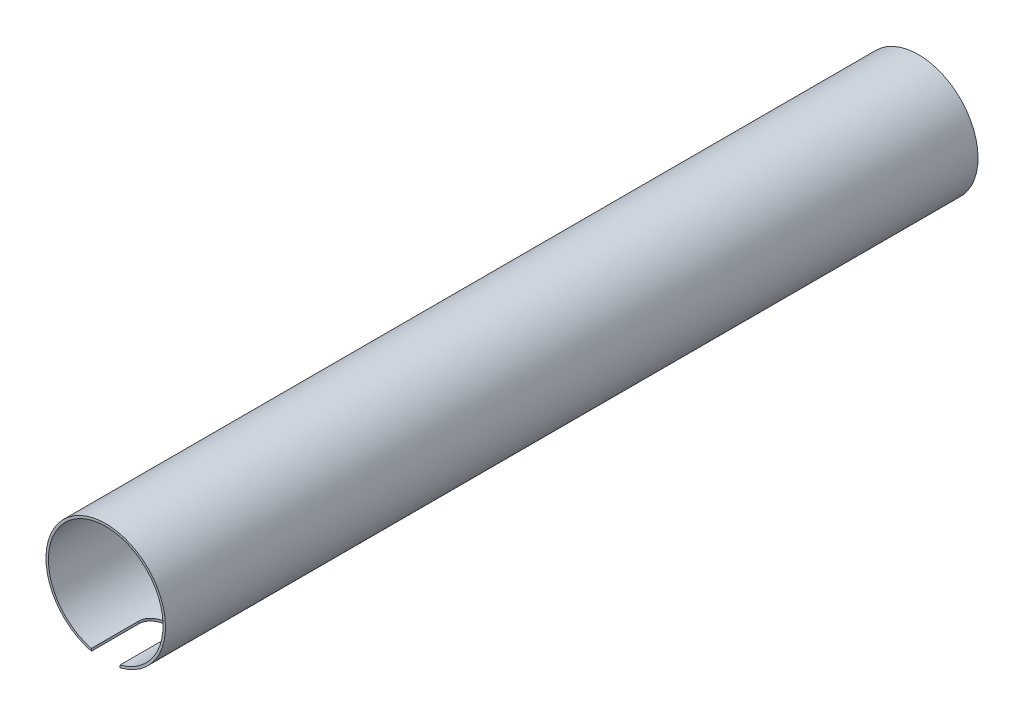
ISO-10303-21;
HEADER;
FILE_DESCRIPTION(('STEP AP214'),'2;1');
FILE_NAME('part.step','',(''),(''),'','','');
FILE_SCHEMA(('AUTOMOTIVE_DESIGN { 1 0 10303 214 1 1 1 1 }'));
ENDSEC;
DATA;
#1=APPLICATION_CONTEXT('core data for automotive mechanical design processes');
#2=APPLICATION_PROTOCOL_DEFINITION('international standard','automotive_design',2000,#1);
#3=PRODUCT_CONTEXT('',#1,'mechanical');
#4=PRODUCT('Part','Part','',(#3));
#5=PRODUCT_RELATED_PRODUCT_CATEGORY('part','',(#4));
#6=PRODUCT_DEFINITION_FORMATION('','',#4);
#7=PRODUCT_DEFINITION_CONTEXT('part definition',#1,'design');
#8=PRODUCT_DEFINITION('design','',#6,#7);
#9=PRODUCT_DEFINITION_SHAPE('','',#8);
#10=(LENGTH_UNIT() NAMED_UNIT(*) SI_UNIT(.MILLI.,.METRE.));
#11=(NAMED_UNIT(*) PLANE_ANGLE_UNIT() SI_UNIT($,.RADIAN.));
#12=(NAMED_UNIT(*) SI_UNIT($,.STERADIAN.) SOLID_ANGLE_UNIT());
#13=UNCERTAINTY_MEASURE_WITH_UNIT(LENGTH_MEASURE(1.E-05),#10,'distance_accuracy_value','');
#14=(GEOMETRIC_REPRESENTATION_CONTEXT(3) GLOBAL_UNCERTAINTY_ASSIGNED_CONTEXT((#13)) GLOBAL_UNIT_ASSIGNED_CONTEXT((#10,
#11,#12)) REPRESENTATION_CONTEXT('',''));
#15=CARTESIAN_POINT('',(0.,0.,0.));
#16=DIRECTION('',(0.,0.,1.));
#17=DIRECTION('',(1.,0.,0.));
#18=AXIS2_PLACEMENT_3D('',#15,#16,#17);
#19=CARTESIAN_POINT('',(3.,-12.5,180.));
#20=DIRECTION('',(1.,0.,0.));
#21=DIRECTION('',(0.,0.,-1.));
#22=AXIS2_PLACEMENT_3D('',#19,#20,#21);
#23=PLANE('',#22);
#24=DIRECTION('',(0.,1.,0.));
#25=VECTOR('',#24,1.);
#26=CARTESIAN_POINT('',(3.,0.,170.));
#27=LINE('',#26,#25);
#28=CARTESIAN_POINT('',(3.,-12.1346610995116,170.));
#29=VERTEX_POINT('',#28);
#30=CARTESIAN_POINT('',(3.,-11.6189500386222,170.));
#31=VERTEX_POINT('',#30);
#32=EDGE_CURVE('E186',#29,#31,#27,.T.);
#33=ORIENTED_EDGE('',*,*,#32,.T.);
#34=DIRECTION('',(0.,0.,-1.));
#35=VECTOR('',#34,1.);
#36=CARTESIAN_POINT('',(3.,-11.6189500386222,170.));
#37=LINE('',#36,#35);
#38=CARTESIAN_POINT('',(3.,-11.6189500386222,160.));
#39=VERTEX_POINT('',#38);
#40=EDGE_CURVE('E188',#31,#39,#37,.T.);
#41=ORIENTED_EDGE('',*,*,#40,.T.);
#42=DIRECTION('',(0.,1.,0.));
#43=VECTOR('',#42,1.);
#44=CARTESIAN_POINT('',(3.,-12.5,160.));
#45=LINE('',#44,#43);
#46=CARTESIAN_POINT('',(3.,-12.1346610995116,160.));
#47=VERTEX_POINT('',#46);
#48=EDGE_CURVE('E11',#47,#39,#45,.T.);
#49=ORIENTED_EDGE('',*,*,#48,.F.);
#50=DIRECTION('',(0.,0.,-1.));
#51=VECTOR('',#50,1.);
#52=CARTESIAN_POINT('',(3.,-12.1346610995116,170.));
#53=LINE('',#52,#51);
#54=EDGE_CURVE('E154',#29,#47,#53,.T.);
#55=ORIENTED_EDGE('',*,*,#54,.F.);
#56=EDGE_LOOP('',(#33,#41,#49,#55));
#57=FACE_BOUND('',#56,.T.);
#58=ADVANCED_FACE('F17',(#57),#23,.F.);
#59=CARTESIAN_POINT('',(0.,-12.5,160.));
#60=DIRECTION('',(0.,1.,0.));
#61=DIRECTION('',(0.,0.,1.));
#62=AXIS2_PLACEMENT_3D('',#59,#60,#61);
#63=CYLINDRICAL_SURFACE('',#62,3.);
#64=ORIENTED_EDGE('',*,*,#48,.T.);
#65=CARTESIAN_POINT('',(3.,-11.6189500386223,160.));
#66=CARTESIAN_POINT('',(3.00000961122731,-11.6189407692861,159.91703465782));
#67=CARTESIAN_POINT('',(2.99655852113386,-11.6198384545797,159.834075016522));
#68=CARTESIAN_POINT('',(2.98280958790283,-11.623378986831,159.668776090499));
#69=CARTESIAN_POINT('',(2.9725128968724,-11.6260215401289,159.586436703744));
#70=CARTESIAN_POINT('',(2.94517439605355,-11.632976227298,159.423120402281));
#71=CARTESIAN_POINT('',(2.92814595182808,-11.6372850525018,159.342141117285));
#72=CARTESIAN_POINT('',(2.88750208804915,-11.6474360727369,159.181973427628));
#73=CARTESIAN_POINT('',(2.86388657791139,-11.6532782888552,159.102785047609));
#74=CARTESIAN_POINT('',(2.78341859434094,-11.67286043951,158.868747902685));
#75=CARTESIAN_POINT('',(2.71691695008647,-11.6886633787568,158.717263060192));
#76=CARTESIAN_POINT('',(2.56023959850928,-11.7239746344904,158.427632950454));
#77=CARTESIAN_POINT('',(2.47005754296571,-11.7434839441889,158.289491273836));
#78=CARTESIAN_POINT('',(2.26645521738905,-11.7844877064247,158.027377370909));
#79=CARTESIAN_POINT('',(2.15261228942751,-11.806013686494,157.903737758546));
#80=CARTESIAN_POINT('',(1.90582685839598,-11.8483531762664,157.677091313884));
#81=CARTESIAN_POINT('',(1.7728813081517,-11.8691665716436,157.574087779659));
#82=CARTESIAN_POINT('',(1.48937083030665,-11.9080854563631,157.390267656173));
#83=CARTESIAN_POINT('',(1.33858605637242,-11.926149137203,157.309780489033));
#84=CARTESIAN_POINT('',(1.0251077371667,-11.9571703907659,157.17542562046));
#85=CARTESIAN_POINT('',(0.862416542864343,-11.9701289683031,157.12155268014));
#86=CARTESIAN_POINT('',(0.533232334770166,-11.9892569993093,157.043023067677));
#87=CARTESIAN_POINT('',(0.366882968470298,-11.9955585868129,157.01779699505));
#88=CARTESIAN_POINT('',(0.0321983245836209,-12.0011231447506,156.995489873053));
#89=CARTESIAN_POINT('',(-0.136136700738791,-12.0003869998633,156.998405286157));
#90=CARTESIAN_POINT('',(-0.4660574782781,-11.9920571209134,157.03188989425));
#91=CARTESIAN_POINT('',(-0.627710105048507,-11.984615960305,157.061843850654));
#92=CARTESIAN_POINT('',(-0.943616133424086,-11.9638899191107,157.147566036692));
#93=CARTESIAN_POINT('',(-1.097869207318,-11.9506047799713,157.203335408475));
#94=CARTESIAN_POINT('',(-1.39622185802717,-11.9194499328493,157.339603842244));
#95=CARTESIAN_POINT('',(-1.54021688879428,-11.901539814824,157.420322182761));
#96=CARTESIAN_POINT('',(-1.8128298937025,-11.8630783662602,157.604029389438));
#97=CARTESIAN_POINT('',(-1.94144554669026,-11.8425266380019,157.707021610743));
#98=CARTESIAN_POINT('',(-2.18330816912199,-11.8003669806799,157.935636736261));
#99=CARTESIAN_POINT('',(-2.2960473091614,-11.7787455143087,158.061794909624));
#100=CARTESIAN_POINT('',(-2.49890872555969,-11.7373850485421,158.331489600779));
#101=CARTESIAN_POINT('',(-2.58902481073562,-11.7176465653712,158.475030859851));
#102=CARTESIAN_POINT('',(-2.74441412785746,-11.6822344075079,158.776436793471));
#103=CARTESIAN_POINT('',(-2.80955105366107,-11.666583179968,158.934374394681));
#104=CARTESIAN_POINT('',(-2.91210705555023,-11.6414117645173,159.259350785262));
#105=CARTESIAN_POINT('',(-2.94956756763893,-11.6318824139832,159.426375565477));
#106=CARTESIAN_POINT('',(-2.98171390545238,-11.6236587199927,159.66237214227));
#107=CARTESIAN_POINT('',(-2.98857237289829,-11.6218956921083,159.729759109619));
#108=CARTESIAN_POINT('',(-2.99771027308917,-11.6195418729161,159.864753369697));
#109=CARTESIAN_POINT('',(-2.99999711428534,-11.6189491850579,159.932360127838));
#110=CARTESIAN_POINT('',(-3.,-11.6189500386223,160.));
#111=B_SPLINE_CURVE_WITH_KNOTS('',3,(#65,#66,#67,#68,#69,#70,#71,#72,#73,#74,#75,#76,#77,#78,
#79,#80,#81,#82,#83,#84,#85,#86,#87,#88,#89,#90,#91,#92,#93,#94,#95,#96,#97,#98,#99,#100,#101,
#102,#103,#104,#105,#106,#107,#108,#109,#110),.UNSPECIFIED.,.F.,.F.,(4,2,2,2,2,2,2,2,2,2,2,2,2,
2,2,2,2,2,2,2,2,2,4),(0.,0.248809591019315,0.497577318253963,0.745853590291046,
0.994133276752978,1.49019923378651,1.98639831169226,2.49236907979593,2.99842064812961,
3.51152900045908,4.02453630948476,4.52715783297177,5.02971617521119,5.52111975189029,
6.01254507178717,6.50841867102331,7.0043670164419,7.51368627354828,8.02314476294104,
8.53534499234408,9.04677681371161,9.24991884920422,9.45273141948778),.UNSPECIFIED.);
#112=CARTESIAN_POINT('',(-3.,-11.6189500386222,160.));
#113=VERTEX_POINT('',#112);
#114=EDGE_CURVE('E129',#39,#113,#111,.T.);
#115=ORIENTED_EDGE('',*,*,#114,.T.);
#116=DIRECTION('',(0.,1.,0.));
#117=VECTOR('',#116,1.);
#118=CARTESIAN_POINT('',(-3.,-12.5,160.));
#119=LINE('',#118,#117);
#120=CARTESIAN_POINT('',(-3.,-12.1346610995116,160.));
#121=VERTEX_POINT('',#120);
#122=EDGE_CURVE('E33',#121,#113,#119,.T.);
#123=ORIENTED_EDGE('',*,*,#122,.F.);
#124=CARTESIAN_POINT('',(3.,-12.1346610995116,160.));
#125=CARTESIAN_POINT('',(3.00000949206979,-12.1346522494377,159.916922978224));
#126=CARTESIAN_POINT('',(2.9965492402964,-12.1355140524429,159.833851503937));
#127=CARTESIAN_POINT('',(2.9827629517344,-12.1389133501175,159.668327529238));
#128=CARTESIAN_POINT('',(2.97243800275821,-12.1414505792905,159.585874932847));
#129=CARTESIAN_POINT('',(2.94502172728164,-12.1481288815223,159.422323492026));
#130=CARTESIAN_POINT('',(2.92794313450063,-12.1522669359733,159.341222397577));
#131=CARTESIAN_POINT('',(2.88717657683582,-12.1620165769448,159.180811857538));
#132=CARTESIAN_POINT('',(2.86348853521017,-12.1676281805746,159.101502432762));
#133=CARTESIAN_POINT('',(2.7827647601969,-12.1864398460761,158.86709852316));
#134=CARTESIAN_POINT('',(2.71604288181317,-12.2016236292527,158.715371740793));
#135=CARTESIAN_POINT('',(2.55882843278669,-12.2355556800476,158.425304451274));
#136=CARTESIAN_POINT('',(2.46833033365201,-12.2543047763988,158.286967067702));
#137=CARTESIAN_POINT('',(2.26416625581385,-12.2936784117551,158.024742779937));
#138=CARTESIAN_POINT('',(2.15010988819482,-12.3143307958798,157.901163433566));
#139=CARTESIAN_POINT('',(1.90290471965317,-12.3549430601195,157.67469002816));
#140=CARTESIAN_POINT('',(1.76975289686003,-12.3749028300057,157.571799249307));
#141=CARTESIAN_POINT('',(1.48603085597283,-12.4121880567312,157.388371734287));
#142=CARTESIAN_POINT('',(1.33525974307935,-12.4294765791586,157.308137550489));
#143=CARTESIAN_POINT('',(1.02189537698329,-12.4591517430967,157.174270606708));
#144=CARTESIAN_POINT('',(0.859304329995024,-12.4715392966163,157.120632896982));
#145=CARTESIAN_POINT('',(0.530138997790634,-12.4898199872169,157.042462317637));
#146=CARTESIAN_POINT('',(0.363696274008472,-12.4958303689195,157.017403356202));
#147=CARTESIAN_POINT('',(0.028864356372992,-12.5010873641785,156.995452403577));
#148=CARTESIAN_POINT('',(-0.139524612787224,-12.5003347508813,156.998557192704));
#149=CARTESIAN_POINT('',(-0.469819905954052,-12.4922383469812,157.032463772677));
#150=CARTESIAN_POINT('',(-0.631788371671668,-12.4850297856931,157.062697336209));
#151=CARTESIAN_POINT('',(-0.948281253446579,-12.464987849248,157.149092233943));
#152=CARTESIAN_POINT('',(-1.10280535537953,-12.4521542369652,157.205254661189));
#153=CARTESIAN_POINT('',(-1.40155039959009,-12.4220935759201,157.342387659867));
#154=CARTESIAN_POINT('',(-1.54567254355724,-12.4048300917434,157.423565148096));
#155=CARTESIAN_POINT('',(-1.81844702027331,-12.3677898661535,157.608266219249));
#156=CARTESIAN_POINT('',(-1.94709723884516,-12.3480127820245,157.711792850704));
#157=CARTESIAN_POINT('',(-2.18865245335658,-12.307525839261,157.941301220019));
#158=CARTESIAN_POINT('',(-2.30108617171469,-12.2868050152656,158.067777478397));
#159=CARTESIAN_POINT('',(-2.50327463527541,-12.2472145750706,158.338044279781));
#160=CARTESIAN_POINT('',(-2.59302318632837,-12.2283454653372,158.481839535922));
#161=CARTESIAN_POINT('',(-2.74756993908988,-12.1945549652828,158.783555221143));
#162=CARTESIAN_POINT('',(-2.81224875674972,-12.1796525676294,158.941538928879));
#163=CARTESIAN_POINT('',(-2.91390343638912,-12.1557369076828,159.266484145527));
#164=CARTESIAN_POINT('',(-2.95092063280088,-12.1467148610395,159.43343185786));
#165=CARTESIAN_POINT('',(-2.98233825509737,-12.139016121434,159.668168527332));
#166=CARTESIAN_POINT('',(-2.98896283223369,-12.1373853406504,159.734406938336));
#167=CARTESIAN_POINT('',(-2.9977885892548,-12.1352084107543,159.867086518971));
#168=CARTESIAN_POINT('',(-2.99999700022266,-12.1346604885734,159.933527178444));
#169=CARTESIAN_POINT('',(-3.,-12.1346610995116,160.));
#170=B_SPLINE_CURVE_WITH_KNOTS('',3,(#124,#125,#126,#127,#128,#129,#130,#131,#132,#133,#134,
#135,#136,#137,#138,#139,#140,#141,#142,#143,#144,#145,#146,#147,#148,#149,#150,#151,#152,#153,
#154,#155,#156,#157,#158,#159,#160,#161,#162,#163,#164,#165,#166,#167,#168,#169),.UNSPECIFIED.,
.F.,.F.,(4,2,2,2,2,2,2,2,2,2,2,2,2,2,2,2,2,2,2,2,2,2,4),(0.,0.249144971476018,0.498250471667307,
0.746888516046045,0.99552944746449,1.49234020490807,1.98926658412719,2.49520478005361,
3.00122312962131,3.51370966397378,4.02610078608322,4.52889907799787,5.03163989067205,
5.52409016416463,6.01656119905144,6.51322041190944,7.00994741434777,7.51903074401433,
8.02825292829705,8.53987111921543,9.05072326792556,9.2503660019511,9.44968157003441),.UNSPECIFIED.);
#171=EDGE_CURVE('E146',#47,#121,#170,.T.);
#172=ORIENTED_EDGE('',*,*,#171,.F.);
#173=EDGE_LOOP('',(#64,#115,#123,#172));
#174=FACE_BOUND('',#173,.T.);
#175=ADVANCED_FACE('F155',(#174),#63,.F.);
#176=CARTESIAN_POINT('',(-3.,-12.5,180.));
#177=DIRECTION('',(-1.,0.,0.));
#178=DIRECTION('',(0.,1.,0.));
#179=AXIS2_PLACEMENT_3D('',#176,#177,#178);
#180=PLANE('',#179);
#181=ORIENTED_EDGE('',*,*,#122,.T.);
#182=DIRECTION('',(0.,0.,1.));
#183=VECTOR('',#182,1.);
#184=CARTESIAN_POINT('',(-3.,-11.6189500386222,170.));
#185=LINE('',#184,#183);
#186=CARTESIAN_POINT('',(-3.,-11.6189500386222,170.));
#187=VERTEX_POINT('',#186);
#188=EDGE_CURVE('E237',#113,#187,#185,.T.);
#189=ORIENTED_EDGE('',*,*,#188,.T.);
#190=DIRECTION('',(0.,-1.,0.));
#191=VECTOR('',#190,1.);
#192=CARTESIAN_POINT('',(-3.,0.,170.));
#193=LINE('',#192,#191);
#194=CARTESIAN_POINT('',(-3.,-12.1346610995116,170.));
#195=VERTEX_POINT('',#194);
#196=EDGE_CURVE('E196',#187,#195,#193,.T.);
#197=ORIENTED_EDGE('',*,*,#196,.T.);
#198=DIRECTION('',(0.,0.,1.));
#199=VECTOR('',#198,1.);
#200=CARTESIAN_POINT('',(-3.,-12.1346610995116,170.));
#201=LINE('',#200,#199);
#202=EDGE_CURVE('E153',#121,#195,#201,.T.);
#203=ORIENTED_EDGE('',*,*,#202,.F.);
#204=EDGE_LOOP('',(#181,#189,#197,#203));
#205=FACE_BOUND('',#204,.T.);
#206=ADVANCED_FACE('F159',(#205),#180,.F.);
#207=CARTESIAN_POINT('',(3.,-12.5,10.));
#208=DIRECTION('',(1.,0.,0.));
#209=DIRECTION('',(0.,0.,-1.));
#210=AXIS2_PLACEMENT_3D('',#207,#208,#209);
#211=PLANE('',#210);
#212=DIRECTION('',(0.,1.,0.));
#213=VECTOR('',#212,1.);
#214=CARTESIAN_POINT('',(3.,-12.5,10.));
#215=LINE('',#214,#213);
#216=CARTESIAN_POINT('',(3.,-12.1346610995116,10.));
#217=VERTEX_POINT('',#216);
#218=CARTESIAN_POINT('',(3.,-11.6189500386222,10.));
#219=VERTEX_POINT('',#218);
#220=EDGE_CURVE('E97',#217,#219,#215,.T.);
#221=ORIENTED_EDGE('',*,*,#220,.T.);
#222=DIRECTION('',(0.,0.,-1.));
#223=VECTOR('',#222,1.);
#224=CARTESIAN_POINT('',(3.,-11.6189500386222,170.));
#225=LINE('',#224,#223);
#226=CARTESIAN_POINT('',(3.,-11.6189500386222,0.));
#227=VERTEX_POINT('',#226);
#228=EDGE_CURVE('E83',#219,#227,#225,.T.);
#229=ORIENTED_EDGE('',*,*,#228,.T.);
#230=DIRECTION('',(0.,1.,0.));
#231=VECTOR('',#230,1.);
#232=CARTESIAN_POINT('',(3.,0.,0.));
#233=LINE('',#232,#231);
#234=CARTESIAN_POINT('',(3.,-12.1346610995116,0.));
#235=VERTEX_POINT('',#234);
#236=EDGE_CURVE('E100',#235,#227,#233,.T.);
#237=ORIENTED_EDGE('',*,*,#236,.F.);
#238=DIRECTION('',(0.,0.,-1.));
#239=VECTOR('',#238,1.);
#240=CARTESIAN_POINT('',(3.,-12.1346610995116,170.));
#241=LINE('',#240,#239);
#242=EDGE_CURVE('E95',#217,#235,#241,.T.);
#243=ORIENTED_EDGE('',*,*,#242,.F.);
#244=EDGE_LOOP('',(#221,#229,#237,#243));
#245=FACE_BOUND('',#244,.T.);
#246=ADVANCED_FACE('F96',(#245),#211,.F.);
#247=CARTESIAN_POINT('',(-3.,-12.5,10.));
#248=DIRECTION('',(-1.,0.,0.));
#249=DIRECTION('',(0.,1.,0.));
#250=AXIS2_PLACEMENT_3D('',#247,#248,#249);
#251=PLANE('',#250);
#252=DIRECTION('',(0.,-1.,0.));
#253=VECTOR('',#252,1.);
#254=CARTESIAN_POINT('',(-3.,0.,0.));
#255=LINE('',#254,#253);
#256=CARTESIAN_POINT('',(-3.,-11.6189500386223,0.));
#257=VERTEX_POINT('',#256);
#258=CARTESIAN_POINT('',(-3.,-12.1346610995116,0.));
#259=VERTEX_POINT('',#258);
#260=EDGE_CURVE('E195',#257,#259,#255,.T.);
#261=ORIENTED_EDGE('',*,*,#260,.F.);
#262=DIRECTION('',(0.,0.,1.));
#263=VECTOR('',#262,1.);
#264=CARTESIAN_POINT('',(-3.,-11.6189500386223,170.));
#265=LINE('',#264,#263);
#266=CARTESIAN_POINT('',(-3.,-11.6189500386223,10.));
#267=VERTEX_POINT('',#266);
#268=EDGE_CURVE('E240',#257,#267,#265,.T.);
#269=ORIENTED_EDGE('',*,*,#268,.T.);
#270=DIRECTION('',(0.,1.,0.));
#271=VECTOR('',#270,1.);
#272=CARTESIAN_POINT('',(-3.,-12.5,10.));
#273=LINE('',#272,#271);
#274=CARTESIAN_POINT('',(-3.,-12.1346610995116,10.));
#275=VERTEX_POINT('',#274);
#276=EDGE_CURVE('E104',#275,#267,#273,.T.);
#277=ORIENTED_EDGE('',*,*,#276,.F.);
#278=DIRECTION('',(0.,0.,1.));
#279=VECTOR('',#278,1.);
#280=CARTESIAN_POINT('',(-3.,-12.1346610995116,170.));
#281=LINE('',#280,#279);
#282=EDGE_CURVE('E105',#259,#275,#281,.T.);
#283=ORIENTED_EDGE('',*,*,#282,.F.);
#284=EDGE_LOOP('',(#261,#269,#277,#283));
#285=FACE_BOUND('',#284,.T.);
#286=ADVANCED_FACE('F164',(#285),#251,.F.);
#287=CARTESIAN_POINT('',(0.,0.,0.));
#288=DIRECTION('',(0.,0.,1.));
#289=DIRECTION('',(1.,0.,0.));
#290=AXIS2_PLACEMENT_3D('',#287,#288,#289);
#291=PLANE('',#290);
#292=CARTESIAN_POINT('',(0.,0.,0.));
#293=DIRECTION('',(0.,0.,1.));
#294=DIRECTION('',(1.,0.,0.));
#295=AXIS2_PLACEMENT_3D('',#292,#293,#294);
#296=CIRCLE('',#295,12.);
#297=EDGE_CURVE('E208',#227,#257,#296,.T.);
#298=ORIENTED_EDGE('',*,*,#297,.T.);
#299=ORIENTED_EDGE('',*,*,#260,.T.);
#300=CARTESIAN_POINT('',(0.,0.,0.));
#301=DIRECTION('',(0.,0.,1.));
#302=DIRECTION('',(1.,0.,0.));
#303=AXIS2_PLACEMENT_3D('',#300,#301,#302);
#304=CIRCLE('',#303,12.5);
#305=EDGE_CURVE('E215',#235,#259,#304,.T.);
#306=ORIENTED_EDGE('',*,*,#305,.F.);
#307=ORIENTED_EDGE('',*,*,#236,.T.);
#308=EDGE_LOOP('',(#298,#299,#306,#307));
#309=FACE_BOUND('',#308,.T.);
#310=ADVANCED_FACE('F167',(#309),#291,.F.);
#311=CARTESIAN_POINT('',(0.,0.,170.));
#312=DIRECTION('',(0.,0.,1.));
#313=DIRECTION('',(1.,0.,0.));
#314=AXIS2_PLACEMENT_3D('',#311,#312,#313);
#315=PLANE('',#314);
#316=ORIENTED_EDGE('',*,*,#196,.F.);
#317=CARTESIAN_POINT('',(0.,0.,170.));
#318=DIRECTION('',(0.,0.,1.));
#319=DIRECTION('',(1.,0.,0.));
#320=AXIS2_PLACEMENT_3D('',#317,#318,#319);
#321=CIRCLE('',#320,12.);
#322=EDGE_CURVE('E110',#31,#187,#321,.T.);
#323=ORIENTED_EDGE('',*,*,#322,.F.);
#324=ORIENTED_EDGE('',*,*,#32,.F.);
#325=CARTESIAN_POINT('',(0.,0.,170.));
#326=DIRECTION('',(0.,0.,1.));
#327=DIRECTION('',(1.,0.,0.));
#328=AXIS2_PLACEMENT_3D('',#325,#326,#327);
#329=CIRCLE('',#328,12.5);
#330=EDGE_CURVE('E204',#29,#195,#329,.T.);
#331=ORIENTED_EDGE('',*,*,#330,.T.);
#332=EDGE_LOOP('',(#316,#323,#324,#331));
#333=FACE_BOUND('',#332,.T.);
#334=ADVANCED_FACE('F143',(#333),#315,.T.);
#335=CARTESIAN_POINT('',(0.,0.,170.));
#336=DIRECTION('',(0.,0.,-1.));
#337=DIRECTION('',(-1.,0.,0.));
#338=AXIS2_PLACEMENT_3D('',#335,#336,#337);
#339=CYLINDRICAL_SURFACE('',#338,12.5);
#340=ORIENTED_EDGE('',*,*,#242,.T.);
#341=ORIENTED_EDGE('',*,*,#305,.T.);
#342=ORIENTED_EDGE('',*,*,#282,.T.);
#343=CARTESIAN_POINT('',(-3.,-12.1346610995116,10.));
#344=CARTESIAN_POINT('',(-3.00000949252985,-12.1346522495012,10.0830769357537));
#345=CARTESIAN_POINT('',(-2.99654924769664,-12.1355140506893,10.1661483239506));
#346=CARTESIAN_POINT('',(-2.98276298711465,-12.1389133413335,10.3316721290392));
#347=CARTESIAN_POINT('',(-2.97243805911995,-12.1414505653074,10.4141246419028));
#348=CARTESIAN_POINT('',(-2.94502181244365,-12.1481288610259,10.5776760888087));
#349=CARTESIAN_POINT('',(-2.92794321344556,-12.1522669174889,10.6587772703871));
#350=CARTESIAN_POINT('',(-2.8871766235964,-12.1620165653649,10.8191879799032));
#351=CARTESIAN_POINT('',(-2.8634885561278,-12.1676281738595,10.8984974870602));
#352=CARTESIAN_POINT('',(-2.78276380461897,-12.1864400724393,11.1329042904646));
#353=CARTESIAN_POINT('',(-2.7160405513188,-12.2016241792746,11.2846337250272));
#354=CARTESIAN_POINT('',(-2.55882508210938,-12.2355563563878,11.5747005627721));
#355=CARTESIAN_POINT('',(-2.46832819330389,-12.2543051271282,11.7130353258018));
#356=CARTESIAN_POINT('',(-2.26417692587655,-12.2936764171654,11.9752438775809));
#357=CARTESIAN_POINT('',(-2.15013401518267,-12.314326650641,12.0988115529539));
#358=CARTESIAN_POINT('',(-1.90293042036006,-12.3549390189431,12.3252893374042));
#359=CARTESIAN_POINT('',(-1.7697628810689,-12.374900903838,12.4281920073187));
#360=CARTESIAN_POINT('',(-1.48596267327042,-12.412197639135,12.6116746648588));
#361=CARTESIAN_POINT('',(-1.33512274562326,-12.429494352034,12.6919422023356));
#362=CARTESIAN_POINT('',(-1.02171331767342,-12.4591641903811,12.8257859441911));
#363=CARTESIAN_POINT('',(-0.85915810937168,-12.4715431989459,12.8793940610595));
#364=CARTESIAN_POINT('',(-0.579818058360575,-12.4870638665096,12.945745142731));
#365=CARTESIAN_POINT('',(-0.46486726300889,-12.4918900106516,12.9660563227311));
#366=CARTESIAN_POINT('',(-0.233293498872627,-12.4983595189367,12.9931862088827));
#367=CARTESIAN_POINT('',(-0.116670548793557,-12.5000029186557,13.0000050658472));
#368=CARTESIAN_POINT('',(0.165912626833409,-12.4999958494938,12.9999927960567));
#369=CARTESIAN_POINT('',(0.331921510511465,-12.4966624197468,12.9861858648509));
#370=CARTESIAN_POINT('',(0.65923405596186,-12.4836820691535,12.9313821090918));
#371=CARTESIAN_POINT('',(0.820533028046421,-12.4740290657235,12.890359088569));
#372=CARTESIAN_POINT('',(1.13359092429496,-12.4494819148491,12.7825061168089));
#373=CARTESIAN_POINT('',(1.28536193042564,-12.4345945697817,12.7157096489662));
#374=CARTESIAN_POINT('',(1.57553285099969,-12.4011715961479,12.5583097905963));
#375=CARTESIAN_POINT('',(1.71393327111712,-12.3826361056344,12.4677073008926));
#376=CARTESIAN_POINT('',(1.97608946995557,-12.3435390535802,12.2634384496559));
#377=CARTESIAN_POINT('',(2.09955371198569,-12.3229482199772,12.1494035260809));
#378=CARTESIAN_POINT('',(2.32580633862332,-12.2822583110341,11.9022860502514));
#379=CARTESIAN_POINT('',(2.4285916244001,-12.2621593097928,11.7692006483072));
#380=CARTESIAN_POINT('',(2.61192623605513,-12.2244325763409,11.4855167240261));
#381=CARTESIAN_POINT('',(2.69214819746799,-12.2068428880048,11.3347013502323));
#382=CARTESIAN_POINT('',(2.82594985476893,-12.176565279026,11.0212685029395));
#383=CARTESIAN_POINT('',(2.87954896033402,-12.1638737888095,10.8586597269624));
#384=CARTESIAN_POINT('',(2.94584186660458,-12.1479541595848,10.5793053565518));
#385=CARTESIAN_POINT('',(2.96612133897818,-12.1430005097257,10.4644015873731));
#386=CARTESIAN_POINT('',(2.99320788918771,-12.1363404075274,10.2330187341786));
#387=CARTESIAN_POINT('',(3.00002562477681,-12.1346313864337,10.1165409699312));
#388=CARTESIAN_POINT('',(3.,-12.1346610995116,10.));
#389=B_SPLINE_CURVE_WITH_KNOTS('',3,(#343,#344,#345,#346,#347,#348,#349,#350,#351,#352,#353,
#354,#355,#356,#357,#358,#359,#360,#361,#362,#363,#364,#365,#366,#367,#368,#369,#370,#371,#372,
#373,#374,#375,#376,#377,#378,#379,#380,#381,#382,#383,#384,#385,#386,#387,#388),.UNSPECIFIED.,
.F.,.F.,(4,2,2,2,2,2,2,2,2,2,2,2,2,2,2,2,2,2,2,2,2,2,4),(0.,0.249144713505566,0.498249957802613,
0.746888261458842,0.99552944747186,1.49234915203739,1.9892665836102,2.49515396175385,
3.00122312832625,3.51396959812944,4.02610080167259,4.37581275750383,4.72552080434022,
5.22282694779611,5.72061245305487,6.21775342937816,6.71487559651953,7.22051506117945,
7.72623024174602,8.23894312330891,8.751281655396,9.10085095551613,9.4501433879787),.UNSPECIFIED.);
#390=EDGE_CURVE('E20',#275,#217,#389,.T.);
#391=ORIENTED_EDGE('',*,*,#390,.T.);
#392=EDGE_LOOP('',(#340,#341,#342,#391));
#393=FACE_BOUND('',#392,.T.);
#394=ORIENTED_EDGE('',*,*,#330,.F.);
#395=ORIENTED_EDGE('',*,*,#54,.T.);
#396=ORIENTED_EDGE('',*,*,#171,.T.);
#397=ORIENTED_EDGE('',*,*,#202,.T.);
#398=EDGE_LOOP('',(#394,#395,#396,#397));
#399=FACE_BOUND('',#398,.T.);
#400=ADVANCED_FACE('F113',(#393,#399),#339,.T.);
#401=CARTESIAN_POINT('',(0.,0.,170.));
#402=DIRECTION('',(0.,0.,-1.));
#403=DIRECTION('',(-1.,0.,0.));
#404=AXIS2_PLACEMENT_3D('',#401,#402,#403);
#405=CYLINDRICAL_SURFACE('',#404,12.);
#406=ORIENTED_EDGE('',*,*,#268,.F.);
#407=ORIENTED_EDGE('',*,*,#297,.F.);
#408=ORIENTED_EDGE('',*,*,#228,.F.);
#409=CARTESIAN_POINT('',(-3.,-11.6189500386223,10.));
#410=CARTESIAN_POINT('',(-3.00000961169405,-11.6189407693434,10.0829652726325));
#411=CARTESIAN_POINT('',(-2.99655852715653,-11.6198384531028,10.1659248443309));
#412=CARTESIAN_POINT('',(-2.98280961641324,-11.6233789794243,10.331223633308));
#413=CARTESIAN_POINT('',(-2.97251294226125,-11.62602152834,10.4135629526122));
#414=CARTESIAN_POINT('',(-2.94517446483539,-11.6329762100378,10.5768792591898));
#415=CARTESIAN_POINT('',(-2.92814601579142,-11.6372850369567,10.657858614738));
#416=CARTESIAN_POINT('',(-2.88750212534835,-11.6474360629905,10.8180264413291));
#417=CARTESIAN_POINT('',(-2.86388659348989,-11.6532782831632,10.8972148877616));
#418=CARTESIAN_POINT('',(-2.78341765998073,-11.6728606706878,11.1312548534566));
#419=CARTESIAN_POINT('',(-2.71691467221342,-11.6886639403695,11.2827422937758));
#420=CARTESIAN_POINT('',(-2.56023632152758,-11.7239753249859,11.5723719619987));
#421=CARTESIAN_POINT('',(-2.47005544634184,-11.7434843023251,11.7105110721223));
#422=CARTESIAN_POINT('',(-2.26646573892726,-11.7844856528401,11.9726094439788));
#423=CARTESIAN_POINT('',(-2.15263608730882,-11.8060094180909,12.0962375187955));
#424=CARTESIAN_POINT('',(-1.90585219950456,-11.8483490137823,12.3228882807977));
#425=CARTESIAN_POINT('',(-1.77289112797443,-11.8691645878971,12.425903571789));
#426=CARTESIAN_POINT('',(-1.48930319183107,-11.9080953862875,12.6097785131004));
#427=CARTESIAN_POINT('',(-1.33845014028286,-11.9261675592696,12.6902989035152));
#428=CARTESIAN_POINT('',(-1.02492691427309,-11.95718331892,12.8246307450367));
#429=CARTESIAN_POINT('',(-0.862271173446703,-11.9701330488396,12.878474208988));
#430=CARTESIAN_POINT('',(-0.582335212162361,-11.9864067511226,12.9452683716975));
#431=CARTESIAN_POINT('',(-0.466898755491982,-11.9914778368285,12.9657573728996));
#432=CARTESIAN_POINT('',(-0.234324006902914,-11.9982759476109,12.9931256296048));
#433=CARTESIAN_POINT('',(-0.11718573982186,-12.0000030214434,13.0000050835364));
#434=CARTESIAN_POINT('',(0.165695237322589,-11.9999957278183,12.9999928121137));
#435=CARTESIAN_POINT('',(0.331485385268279,-11.9965325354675,12.9862216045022));
#436=CARTESIAN_POINT('',(0.658356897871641,-11.9830465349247,12.9315661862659));
#437=CARTESIAN_POINT('',(0.819433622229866,-11.9730174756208,12.8906561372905));
#438=CARTESIAN_POINT('',(1.13204464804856,-11.94751204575,12.7831197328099));
#439=CARTESIAN_POINT('',(1.28359164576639,-11.9320431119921,12.7165284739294));
#440=CARTESIAN_POINT('',(1.57335294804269,-11.8973057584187,12.5596318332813));
#441=CARTESIAN_POINT('',(1.71156759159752,-11.8780374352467,12.4693270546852));
#442=CARTESIAN_POINT('',(1.97360061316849,-11.8373487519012,12.2656010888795));
#443=CARTESIAN_POINT('',(2.09710544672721,-11.8158951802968,12.1517832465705));
#444=CARTESIAN_POINT('',(2.32349328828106,-11.7734733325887,11.9051006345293));
#445=CARTESIAN_POINT('',(2.4263730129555,-11.752505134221,11.7722328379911));
#446=CARTESIAN_POINT('',(2.6100798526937,-11.7130897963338,11.4887714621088));
#447=CARTESIAN_POINT('',(2.69054967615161,-11.6946856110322,11.3379400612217));
#448=CARTESIAN_POINT('',(2.82482847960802,-11.662981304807,11.0243901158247));
#449=CARTESIAN_POINT('',(2.8786574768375,-11.6496773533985,10.8616806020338));
#450=CARTESIAN_POINT('',(2.94537917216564,-11.6329503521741,10.5817486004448));
#451=CARTESIAN_POINT('',(2.96583007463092,-11.6277339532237,10.4663789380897));
#452=CARTESIAN_POINT('',(2.99314899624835,-11.6207190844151,10.2340269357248));
#453=CARTESIAN_POINT('',(3.00002679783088,-11.6189181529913,10.1170458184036));
#454=CARTESIAN_POINT('',(3.,-11.6189500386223,10.));
#455=B_SPLINE_CURVE_WITH_KNOTS('',3,(#409,#410,#411,#412,#413,#414,#415,#416,#417,#418,#419,
#420,#421,#422,#423,#424,#425,#426,#427,#428,#429,#430,#431,#432,#433,#434,#435,#436,#437,#438,
#439,#440,#441,#442,#443,#444,#445,#446,#447,#448,#449,#450,#451,#452,#453,#454),.UNSPECIFIED.,
.F.,.F.,(4,2,2,2,2,2,2,2,2,2,2,2,2,2,2,2,2,2,2,2,2,2,4),(0.,0.248809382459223,0.497576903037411,
0.745853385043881,0.994133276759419,1.49020799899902,1.98639831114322,2.49231887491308,
2.99842064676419,3.51178726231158,4.02453632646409,4.37579155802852,4.72704166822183,
5.22369314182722,5.7208181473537,6.21726616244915,6.713701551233,7.219318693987,
7.72501626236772,8.23836673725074,8.75133090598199,9.10238460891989,9.45318520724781),.UNSPECIFIED.);
#456=EDGE_CURVE('E108',#267,#219,#455,.T.);
#457=ORIENTED_EDGE('',*,*,#456,.F.);
#458=EDGE_LOOP('',(#406,#407,#408,#457));
#459=FACE_BOUND('',#458,.T.);
#460=ORIENTED_EDGE('',*,*,#322,.T.);
#461=ORIENTED_EDGE('',*,*,#188,.F.);
#462=ORIENTED_EDGE('',*,*,#114,.F.);
#463=ORIENTED_EDGE('',*,*,#40,.F.);
#464=EDGE_LOOP('',(#460,#461,#462,#463));
#465=FACE_BOUND('',#464,.T.);
#466=ADVANCED_FACE('F136',(#459,#465),#405,.F.);
#467=CARTESIAN_POINT('',(0.,-12.5,10.));
#468=DIRECTION('',(0.,1.,0.));
#469=DIRECTION('',(0.,0.,1.));
#470=AXIS2_PLACEMENT_3D('',#467,#468,#469);
#471=CYLINDRICAL_SURFACE('',#470,3.);
#472=ORIENTED_EDGE('',*,*,#390,.F.);
#473=ORIENTED_EDGE('',*,*,#276,.T.);
#474=ORIENTED_EDGE('',*,*,#456,.T.);
#475=ORIENTED_EDGE('',*,*,#220,.F.);
#476=EDGE_LOOP('',(#472,#473,#474,#475));
#477=FACE_BOUND('',#476,.T.);
#478=ADVANCED_FACE('F107',(#477),#471,.F.);
#479=CLOSED_SHELL('',(#58,#175,#206,#246,#286,#310,#334,#400,#466,#478));
#480=MANIFOLD_SOLID_BREP('B1',#479);
#481=ADVANCED_BREP_SHAPE_REPRESENTATION('',(#18,#480),#14);
#482=SHAPE_DEFINITION_REPRESENTATION(#9,#481);
ENDSEC;
END-ISO-10303-21;
